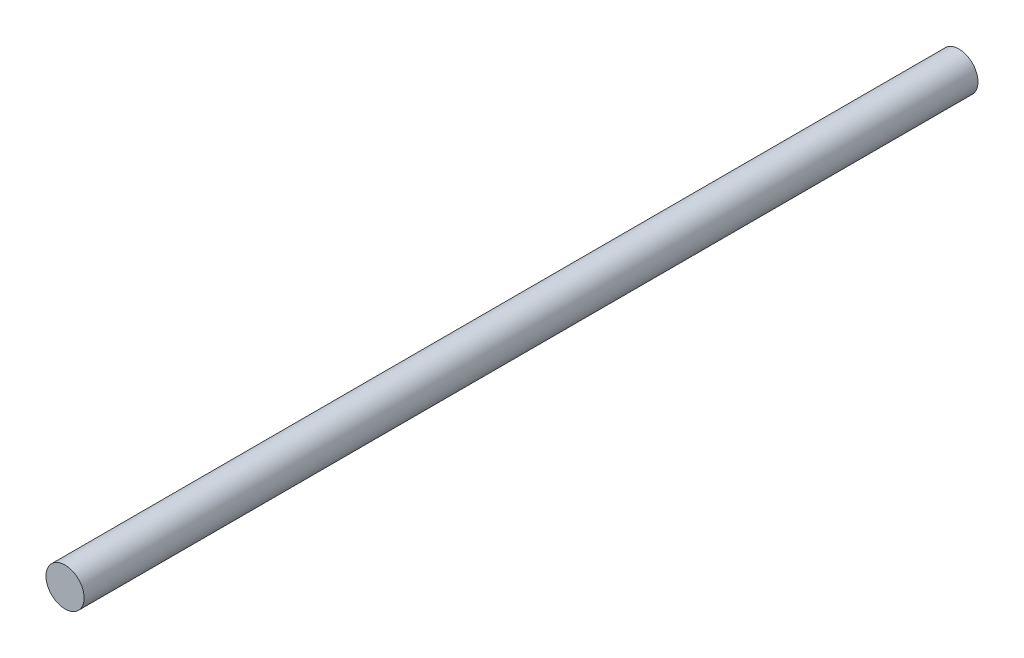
ISO-10303-21;
HEADER;
FILE_DESCRIPTION(('STEP AP214'),'2;1');
FILE_NAME('part.step','',(''),(''),'','','');
FILE_SCHEMA(('AUTOMOTIVE_DESIGN { 1 0 10303 214 1 1 1 1 }'));
ENDSEC;
DATA;
#1=APPLICATION_CONTEXT('core data for automotive mechanical design processes');
#2=APPLICATION_PROTOCOL_DEFINITION('international standard','automotive_design',2000,#1);
#3=PRODUCT_CONTEXT('',#1,'mechanical');
#4=PRODUCT('Part','Part','',(#3));
#5=PRODUCT_RELATED_PRODUCT_CATEGORY('part','',(#4));
#6=PRODUCT_DEFINITION_FORMATION('','',#4);
#7=PRODUCT_DEFINITION_CONTEXT('part definition',#1,'design');
#8=PRODUCT_DEFINITION('design','',#6,#7);
#9=PRODUCT_DEFINITION_SHAPE('','',#8);
#10=(LENGTH_UNIT() NAMED_UNIT(*) SI_UNIT(.MILLI.,.METRE.));
#11=(NAMED_UNIT(*) PLANE_ANGLE_UNIT() SI_UNIT($,.RADIAN.));
#12=(NAMED_UNIT(*) SI_UNIT($,.STERADIAN.) SOLID_ANGLE_UNIT());
#13=UNCERTAINTY_MEASURE_WITH_UNIT(LENGTH_MEASURE(1.E-05),#10,'distance_accuracy_value','');
#14=(GEOMETRIC_REPRESENTATION_CONTEXT(3) GLOBAL_UNCERTAINTY_ASSIGNED_CONTEXT((#13)) GLOBAL_UNIT_ASSIGNED_CONTEXT((#10,
#11,#12)) REPRESENTATION_CONTEXT('',''));
#15=CARTESIAN_POINT('',(0.,0.,0.));
#16=DIRECTION('',(0.,0.,1.));
#17=DIRECTION('',(1.,0.,0.));
#18=AXIS2_PLACEMENT_3D('',#15,#16,#17);
#19=CARTESIAN_POINT('',(0.,0.,75.));
#20=DIRECTION('',(0.,0.,-1.));
#21=DIRECTION('',(-1.,0.,0.));
#22=AXIS2_PLACEMENT_3D('',#19,#20,#21);
#23=CYLINDRICAL_SURFACE('',#22,1.6);
#24=CARTESIAN_POINT('',(0.,0.,75.));
#25=DIRECTION('',(0.,0.,1.));
#26=DIRECTION('',(1.,0.,0.));
#27=AXIS2_PLACEMENT_3D('',#24,#25,#26);
#28=CIRCLE('',#27,1.6);
#29=CARTESIAN_POINT('',(1.6,0.,75.));
#30=VERTEX_POINT('',#29);
#31=EDGE_CURVE('E10',#30,#30,#28,.T.);
#32=ORIENTED_EDGE('',*,*,#31,.F.);
#33=EDGE_LOOP('',(#32));
#34=FACE_BOUND('',#33,.T.);
#35=CARTESIAN_POINT('',(0.,0.,0.));
#36=DIRECTION('',(0.,0.,1.));
#37=DIRECTION('',(1.,0.,0.));
#38=AXIS2_PLACEMENT_3D('',#35,#36,#37);
#39=CIRCLE('',#38,1.6);
#40=CARTESIAN_POINT('',(1.6,0.,0.));
#41=VERTEX_POINT('',#40);
#42=EDGE_CURVE('E35',#41,#41,#39,.T.);
#43=ORIENTED_EDGE('',*,*,#42,.T.);
#44=EDGE_LOOP('',(#43));
#45=FACE_BOUND('',#44,.T.);
#46=ADVANCED_FACE('F32',(#34,#45),#23,.T.);
#47=CARTESIAN_POINT('',(0.,0.,75.));
#48=DIRECTION('',(0.,0.,1.));
#49=DIRECTION('',(1.,0.,0.));
#50=AXIS2_PLACEMENT_3D('',#47,#48,#49);
#51=PLANE('',#50);
#52=ORIENTED_EDGE('',*,*,#31,.T.);
#53=EDGE_LOOP('',(#52));
#54=FACE_BOUND('',#53,.T.);
#55=ADVANCED_FACE('F47',(#54),#51,.T.);
#56=CARTESIAN_POINT('',(0.,0.,0.));
#57=DIRECTION('',(0.,0.,1.));
#58=DIRECTION('',(1.,0.,0.));
#59=AXIS2_PLACEMENT_3D('',#56,#57,#58);
#60=PLANE('',#59);
#61=ORIENTED_EDGE('',*,*,#42,.F.);
#62=EDGE_LOOP('',(#61));
#63=FACE_BOUND('',#62,.T.);
#64=ADVANCED_FACE('F45',(#63),#60,.F.);
#65=CLOSED_SHELL('',(#46,#55,#64));
#66=MANIFOLD_SOLID_BREP('B2',#65);
#67=ADVANCED_BREP_SHAPE_REPRESENTATION('',(#18,#66),#14);
#68=SHAPE_DEFINITION_REPRESENTATION(#9,#67);
ENDSEC;
END-ISO-10303-21;
